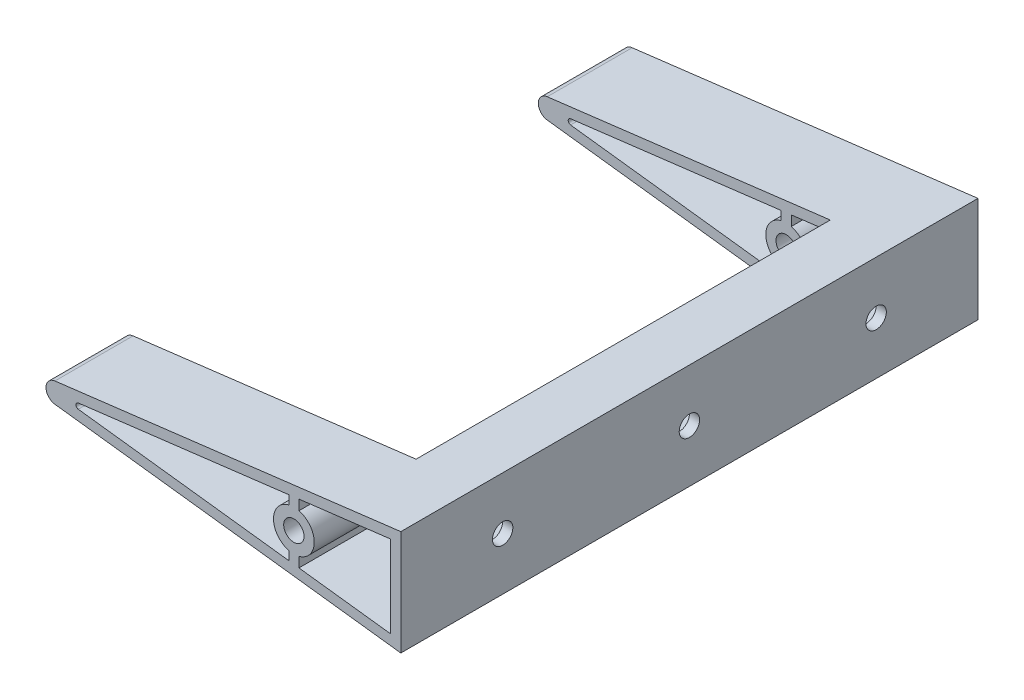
ISO-10303-21;
HEADER;
FILE_DESCRIPTION(('STEP AP214'),'2;1');
FILE_NAME('part.step','',(''),(''),'','','');
FILE_SCHEMA(('AUTOMOTIVE_DESIGN { 1 0 10303 214 1 1 1 1 }'));
ENDSEC;
DATA;
#1=APPLICATION_CONTEXT('core data for automotive mechanical design processes');
#2=APPLICATION_PROTOCOL_DEFINITION('international standard','automotive_design',2000,#1);
#3=PRODUCT_CONTEXT('',#1,'mechanical');
#4=PRODUCT('Part','Part','',(#3));
#5=PRODUCT_RELATED_PRODUCT_CATEGORY('part','',(#4));
#6=PRODUCT_DEFINITION_FORMATION('','',#4);
#7=PRODUCT_DEFINITION_CONTEXT('part definition',#1,'design');
#8=PRODUCT_DEFINITION('design','',#6,#7);
#9=PRODUCT_DEFINITION_SHAPE('','',#8);
#10=(LENGTH_UNIT() NAMED_UNIT(*) SI_UNIT(.MILLI.,.METRE.));
#11=(NAMED_UNIT(*) PLANE_ANGLE_UNIT() SI_UNIT($,.RADIAN.));
#12=(NAMED_UNIT(*) SI_UNIT($,.STERADIAN.) SOLID_ANGLE_UNIT());
#13=UNCERTAINTY_MEASURE_WITH_UNIT(LENGTH_MEASURE(1.E-05),#10,'distance_accuracy_value','');
#14=(GEOMETRIC_REPRESENTATION_CONTEXT(3) GLOBAL_UNCERTAINTY_ASSIGNED_CONTEXT((#13)) GLOBAL_UNIT_ASSIGNED_CONTEXT((#10,
#11,#12)) REPRESENTATION_CONTEXT('',''));
#15=CARTESIAN_POINT('',(0.,0.,0.));
#16=DIRECTION('',(0.,0.,1.));
#17=DIRECTION('',(1.,0.,0.));
#18=AXIS2_PLACEMENT_3D('',#15,#16,#17);
#19=CARTESIAN_POINT('',(-63.3803395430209,0.,120.));
#20=DIRECTION('',(0.,0.,-1.));
#21=DIRECTION('',(-1.,0.,0.));
#22=AXIS2_PLACEMENT_3D('',#19,#20,#21);
#23=CYLINDRICAL_SURFACE('',#22,0.806945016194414);
#24=CARTESIAN_POINT('',(-63.3803395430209,0.,25.));
#25=DIRECTION('',(0.,0.,-1.));
#26=DIRECTION('',(-1.,0.,0.));
#27=AXIS2_PLACEMENT_3D('',#24,#25,#26);
#28=CIRCLE('',#27,0.806945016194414);
#29=CARTESIAN_POINT('',(-63.496985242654,-0.79846981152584,25.));
#30=VERTEX_POINT('',#29);
#31=CARTESIAN_POINT('',(-63.496985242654,0.79846981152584,25.));
#32=VERTEX_POINT('',#31);
#33=EDGE_CURVE('E323',#30,#32,#28,.T.);
#34=ORIENTED_EDGE('',*,*,#33,.F.);
#35=DIRECTION('',(0.,0.,-1.));
#36=VECTOR('',#35,1.);
#37=CARTESIAN_POINT('',(-63.496985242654,-0.79846981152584,120.));
#38=LINE('',#37,#36);
#39=CARTESIAN_POINT('',(-63.496985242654,-0.79846981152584,0.));
#40=VERTEX_POINT('',#39);
#41=EDGE_CURVE('E454',#30,#40,#38,.T.);
#42=ORIENTED_EDGE('',*,*,#41,.T.);
#43=CARTESIAN_POINT('',(-63.3803395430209,0.,0.));
#44=DIRECTION('',(0.,0.,1.));
#45=DIRECTION('',(-1.,0.,0.));
#46=AXIS2_PLACEMENT_3D('',#43,#44,#45);
#47=CIRCLE('',#46,0.806945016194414);
#48=CARTESIAN_POINT('',(-63.496985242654,0.79846981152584,0.));
#49=VERTEX_POINT('',#48);
#50=EDGE_CURVE('E416',#49,#40,#47,.T.);
#51=ORIENTED_EDGE('',*,*,#50,.F.);
#52=DIRECTION('',(0.,0.,-1.));
#53=VECTOR('',#52,1.);
#54=CARTESIAN_POINT('',(-63.496985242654,0.79846981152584,120.));
#55=LINE('',#54,#53);
#56=EDGE_CURVE('E434',#32,#49,#55,.T.);
#57=ORIENTED_EDGE('',*,*,#56,.F.);
#58=EDGE_LOOP('',(#34,#42,#51,#57));
#59=FACE_BOUND('',#58,.T.);
#60=ADVANCED_FACE('F32',(#59),#23,.F.);
#61=CARTESIAN_POINT('',(-63.496985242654,-0.79846981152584,120.));
#62=DIRECTION('',(0.121869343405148,0.992546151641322,0.));
#63=DIRECTION('',(-0.992546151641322,0.121869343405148,0.));
#64=AXIS2_PLACEMENT_3D('',#61,#62,#63);
#65=PLANE('',#64);
#66=DIRECTION('',(-0.992546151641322,0.121869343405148,0.));
#67=VECTOR('',#66,1.);
#68=CARTESIAN_POINT('',(-63.496985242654,-0.79846981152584,25.));
#69=LINE('',#68,#67);
#70=CARTESIAN_POINT('',(-1.50000000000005,-8.41074242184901,25.));
#71=VERTEX_POINT('',#70);
#72=EDGE_CURVE('E321',#71,#30,#69,.T.);
#73=ORIENTED_EDGE('',*,*,#72,.F.);
#74=DIRECTION('',(0.,0.,-1.));
#75=VECTOR('',#74,1.);
#76=CARTESIAN_POINT('',(-1.50000000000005,-8.41074242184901,120.));
#77=LINE('',#76,#75);
#78=CARTESIAN_POINT('',(-1.50000000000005,-8.41074242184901,0.));
#79=VERTEX_POINT('',#78);
#80=EDGE_CURVE('E450',#71,#79,#77,.T.);
#81=ORIENTED_EDGE('',*,*,#80,.T.);
#82=DIRECTION('',(0.992546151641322,-0.121869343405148,0.));
#83=VECTOR('',#82,1.);
#84=CARTESIAN_POINT('',(-63.496985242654,-0.79846981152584,0.));
#85=LINE('',#84,#83);
#86=EDGE_CURVE('E419',#40,#79,#85,.T.);
#87=ORIENTED_EDGE('',*,*,#86,.F.);
#88=ORIENTED_EDGE('',*,*,#41,.F.);
#89=EDGE_LOOP('',(#73,#81,#87,#88));
#90=FACE_BOUND('',#89,.T.);
#91=ADVANCED_FACE('F593',(#90),#65,.T.);
#92=CARTESIAN_POINT('',(-1.50000000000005,-8.41074242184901,120.));
#93=DIRECTION('',(-1.,0.,0.));
#94=DIRECTION('',(0.,-1.,0.));
#95=AXIS2_PLACEMENT_3D('',#92,#93,#94);
#96=PLANE('',#95);
#97=DIRECTION('',(0.,-1.,0.));
#98=VECTOR('',#97,1.);
#99=CARTESIAN_POINT('',(-1.50000000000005,-8.41074242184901,25.));
#100=LINE('',#99,#98);
#101=CARTESIAN_POINT('',(-1.50000000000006,-5.80947501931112,25.));
#102=VERTEX_POINT('',#101);
#103=EDGE_CURVE('E319',#102,#71,#100,.T.);
#104=ORIENTED_EDGE('',*,*,#103,.F.);
#105=DIRECTION('',(0.,0.,-1.));
#106=VECTOR('',#105,1.);
#107=CARTESIAN_POINT('',(-1.50000000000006,-5.80947501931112,120.));
#108=LINE('',#107,#106);
#109=CARTESIAN_POINT('',(-1.50000000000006,-5.80947501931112,0.));
#110=VERTEX_POINT('',#109);
#111=EDGE_CURVE('E446',#102,#110,#108,.T.);
#112=ORIENTED_EDGE('',*,*,#111,.T.);
#113=DIRECTION('',(0.,1.,0.));
#114=VECTOR('',#113,1.);
#115=CARTESIAN_POINT('',(-1.50000000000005,-8.41074242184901,0.));
#116=LINE('',#115,#114);
#117=EDGE_CURVE('E422',#79,#110,#116,.T.);
#118=ORIENTED_EDGE('',*,*,#117,.F.);
#119=ORIENTED_EDGE('',*,*,#80,.F.);
#120=EDGE_LOOP('',(#104,#112,#118,#119));
#121=FACE_BOUND('',#120,.T.);
#122=ADVANCED_FACE('F600',(#121),#96,.T.);
#123=CARTESIAN_POINT('',(0.,0.,120.));
#124=DIRECTION('',(0.,0.,-1.));
#125=DIRECTION('',(-1.,0.,0.));
#126=AXIS2_PLACEMENT_3D('',#123,#124,#125);
#127=CYLINDRICAL_SURFACE('',#126,6.00000000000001);
#128=CARTESIAN_POINT('',(0.,0.,25.));
#129=DIRECTION('',(0.,0.,-1.));
#130=DIRECTION('',(-1.,0.,0.));
#131=AXIS2_PLACEMENT_3D('',#128,#129,#130);
#132=CIRCLE('',#131,6.00000000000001);
#133=CARTESIAN_POINT('',(-1.5,5.80947501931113,25.));
#134=VERTEX_POINT('',#133);
#135=EDGE_CURVE('E317',#134,#102,#132,.F.);
#136=ORIENTED_EDGE('',*,*,#135,.F.);
#137=DIRECTION('',(0.,0.,-1.));
#138=VECTOR('',#137,1.);
#139=CARTESIAN_POINT('',(-1.5,5.80947501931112,120.));
#140=LINE('',#139,#138);
#141=CARTESIAN_POINT('',(-1.5,5.80947501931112,0.));
#142=VERTEX_POINT('',#141);
#143=EDGE_CURVE('E442',#134,#142,#140,.T.);
#144=ORIENTED_EDGE('',*,*,#143,.T.);
#145=CARTESIAN_POINT('',(0.,0.,0.));
#146=DIRECTION('',(0.,0.,-1.));
#147=DIRECTION('',(1.,0.,0.));
#148=AXIS2_PLACEMENT_3D('',#145,#146,#147);
#149=CIRCLE('',#148,6.00000000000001);
#150=EDGE_CURVE('E425',#110,#142,#149,.T.);
#151=ORIENTED_EDGE('',*,*,#150,.F.);
#152=ORIENTED_EDGE('',*,*,#111,.F.);
#153=EDGE_LOOP('',(#136,#144,#151,#152));
#154=FACE_BOUND('',#153,.T.);
#155=ADVANCED_FACE('F801',(#154),#127,.T.);
#156=CARTESIAN_POINT('',(-1.5,8.41074242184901,120.));
#157=DIRECTION('',(-1.,0.,0.));
#158=DIRECTION('',(0.,-1.,0.));
#159=AXIS2_PLACEMENT_3D('',#156,#157,#158);
#160=PLANE('',#159);
#161=DIRECTION('',(0.,-1.,0.));
#162=VECTOR('',#161,1.);
#163=CARTESIAN_POINT('',(-1.5,8.41074242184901,25.));
#164=LINE('',#163,#162);
#165=CARTESIAN_POINT('',(-1.49999999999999,8.41074242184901,25.));
#166=VERTEX_POINT('',#165);
#167=EDGE_CURVE('E315',#166,#134,#164,.T.);
#168=ORIENTED_EDGE('',*,*,#167,.F.);
#169=DIRECTION('',(0.,0.,-1.));
#170=VECTOR('',#169,1.);
#171=CARTESIAN_POINT('',(-1.5,8.41074242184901,120.));
#172=LINE('',#171,#170);
#173=CARTESIAN_POINT('',(-1.5,8.41074242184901,0.));
#174=VERTEX_POINT('',#173);
#175=EDGE_CURVE('E438',#166,#174,#172,.T.);
#176=ORIENTED_EDGE('',*,*,#175,.T.);
#177=DIRECTION('',(0.,1.,0.));
#178=VECTOR('',#177,1.);
#179=CARTESIAN_POINT('',(-1.5,8.41074242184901,0.));
#180=LINE('',#179,#178);
#181=EDGE_CURVE('E428',#142,#174,#180,.T.);
#182=ORIENTED_EDGE('',*,*,#181,.F.);
#183=ORIENTED_EDGE('',*,*,#143,.F.);
#184=EDGE_LOOP('',(#168,#176,#182,#183));
#185=FACE_BOUND('',#184,.T.);
#186=ADVANCED_FACE('F811',(#185),#160,.T.);
#187=CARTESIAN_POINT('',(-63.496985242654,0.79846981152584,120.));
#188=DIRECTION('',(0.121869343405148,-0.992546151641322,0.));
#189=DIRECTION('',(0.992546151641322,0.121869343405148,0.));
#190=AXIS2_PLACEMENT_3D('',#187,#188,#189);
#191=PLANE('',#190);
#192=DIRECTION('',(0.992546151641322,0.121869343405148,0.));
#193=VECTOR('',#192,1.);
#194=CARTESIAN_POINT('',(-63.496985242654,0.79846981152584,25.));
#195=LINE('',#194,#193);
#196=EDGE_CURVE('E313',#32,#166,#195,.T.);
#197=ORIENTED_EDGE('',*,*,#196,.F.);
#198=ORIENTED_EDGE('',*,*,#56,.T.);
#199=DIRECTION('',(-0.992546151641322,-0.121869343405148,0.));
#200=VECTOR('',#199,1.);
#201=CARTESIAN_POINT('',(-63.496985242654,0.79846981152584,0.));
#202=LINE('',#201,#200);
#203=EDGE_CURVE('E431',#174,#49,#202,.T.);
#204=ORIENTED_EDGE('',*,*,#203,.F.);
#205=ORIENTED_EDGE('',*,*,#175,.F.);
#206=EDGE_LOOP('',(#197,#198,#204,#205));
#207=FACE_BOUND('',#206,.T.);
#208=ADVANCED_FACE('F821',(#207),#191,.T.);
#209=CARTESIAN_POINT('',(0.,0.,120.));
#210=DIRECTION('',(0.,0.,-1.));
#211=DIRECTION('',(-1.,0.,0.));
#212=AXIS2_PLACEMENT_3D('',#209,#210,#211);
#213=CYLINDRICAL_SURFACE('',#212,3.);
#214=CARTESIAN_POINT('',(0.,0.,25.));
#215=DIRECTION('',(0.,0.,-1.));
#216=DIRECTION('',(-1.,0.,0.));
#217=AXIS2_PLACEMENT_3D('',#214,#215,#216);
#218=CIRCLE('',#217,3.);
#219=CARTESIAN_POINT('',(-3.,0.,25.));
#220=VERTEX_POINT('',#219);
#221=EDGE_CURVE('E310',#220,#220,#218,.T.);
#222=ORIENTED_EDGE('',*,*,#221,.F.);
#223=EDGE_LOOP('',(#222));
#224=FACE_BOUND('',#223,.T.);
#225=CARTESIAN_POINT('',(0.,0.,0.));
#226=DIRECTION('',(0.,0.,1.));
#227=DIRECTION('',(-1.,0.,0.));
#228=AXIS2_PLACEMENT_3D('',#225,#226,#227);
#229=CIRCLE('',#228,3.);
#230=CARTESIAN_POINT('',(-3.,0.,0.));
#231=VERTEX_POINT('',#230);
#232=EDGE_CURVE('E413',#231,#231,#229,.T.);
#233=ORIENTED_EDGE('',*,*,#232,.F.);
#234=EDGE_LOOP('',(#233));
#235=FACE_BOUND('',#234,.T.);
#236=ADVANCED_FACE('F832',(#224,#235),#213,.F.);
#237=CARTESIAN_POINT('',(1.5,8.77909610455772,120.));
#238=DIRECTION('',(1.,0.,0.));
#239=DIRECTION('',(0.,1.,0.));
#240=AXIS2_PLACEMENT_3D('',#237,#238,#239);
#241=PLANE('',#240);
#242=DIRECTION('',(0.,1.,0.));
#243=VECTOR('',#242,1.);
#244=CARTESIAN_POINT('',(1.5,8.77909610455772,25.));
#245=LINE('',#244,#243);
#246=CARTESIAN_POINT('',(1.5,5.80947501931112,25.));
#247=VERTEX_POINT('',#246);
#248=CARTESIAN_POINT('',(1.5,8.77909610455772,25.));
#249=VERTEX_POINT('',#248);
#250=EDGE_CURVE('E262',#247,#249,#245,.T.);
#251=ORIENTED_EDGE('',*,*,#250,.F.);
#252=DIRECTION('',(0.,0.,-1.));
#253=VECTOR('',#252,1.);
#254=CARTESIAN_POINT('',(1.49999999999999,5.80947501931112,120.));
#255=LINE('',#254,#253);
#256=CARTESIAN_POINT('',(1.49999999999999,5.80947501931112,0.));
#257=VERTEX_POINT('',#256);
#258=EDGE_CURVE('E409',#247,#257,#255,.T.);
#259=ORIENTED_EDGE('',*,*,#258,.T.);
#260=DIRECTION('',(0.,-1.,0.));
#261=VECTOR('',#260,1.);
#262=CARTESIAN_POINT('',(1.5,8.77909610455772,0.));
#263=LINE('',#262,#261);
#264=CARTESIAN_POINT('',(1.5,8.77909610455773,0.));
#265=VERTEX_POINT('',#264);
#266=EDGE_CURVE('E375',#265,#257,#263,.T.);
#267=ORIENTED_EDGE('',*,*,#266,.F.);
#268=DIRECTION('',(0.,0.,-1.));
#269=VECTOR('',#268,1.);
#270=CARTESIAN_POINT('',(1.5,8.77909610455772,120.));
#271=LINE('',#270,#269);
#272=EDGE_CURVE('E393',#249,#265,#271,.T.);
#273=ORIENTED_EDGE('',*,*,#272,.F.);
#274=EDGE_LOOP('',(#251,#259,#267,#273));
#275=FACE_BOUND('',#274,.T.);
#276=ADVANCED_FACE('F589',(#275),#241,.T.);
#277=CARTESIAN_POINT('',(0.,0.,120.));
#278=DIRECTION('',(0.,0.,-1.));
#279=DIRECTION('',(-1.,0.,0.));
#280=AXIS2_PLACEMENT_3D('',#277,#278,#279);
#281=CYLINDRICAL_SURFACE('',#280,5.99999999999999);
#282=CARTESIAN_POINT('',(0.,0.,25.));
#283=DIRECTION('',(0.,0.,-1.));
#284=DIRECTION('',(-1.,0.,0.));
#285=AXIS2_PLACEMENT_3D('',#282,#283,#284);
#286=CIRCLE('',#285,5.99999999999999);
#287=CARTESIAN_POINT('',(1.49999999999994,-5.80947501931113,25.));
#288=VERTEX_POINT('',#287);
#289=EDGE_CURVE('E304',#288,#247,#286,.F.);
#290=ORIENTED_EDGE('',*,*,#289,.F.);
#291=DIRECTION('',(0.,0.,-1.));
#292=VECTOR('',#291,1.);
#293=CARTESIAN_POINT('',(1.49999999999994,-5.80947501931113,120.));
#294=LINE('',#293,#292);
#295=CARTESIAN_POINT('',(1.49999999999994,-5.80947501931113,0.));
#296=VERTEX_POINT('',#295);
#297=EDGE_CURVE('E405',#288,#296,#294,.T.);
#298=ORIENTED_EDGE('',*,*,#297,.T.);
#299=CARTESIAN_POINT('',(0.,0.,0.));
#300=DIRECTION('',(0.,0.,-1.));
#301=DIRECTION('',(1.,0.,0.));
#302=AXIS2_PLACEMENT_3D('',#299,#300,#301);
#303=CIRCLE('',#302,5.99999999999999);
#304=EDGE_CURVE('E378',#257,#296,#303,.T.);
#305=ORIENTED_EDGE('',*,*,#304,.F.);
#306=ORIENTED_EDGE('',*,*,#258,.F.);
#307=EDGE_LOOP('',(#290,#298,#305,#306));
#308=FACE_BOUND('',#307,.T.);
#309=ADVANCED_FACE('F580',(#308),#281,.T.);
#310=CARTESIAN_POINT('',(1.49999999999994,-8.77909610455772,120.));
#311=DIRECTION('',(1.,0.,0.));
#312=DIRECTION('',(0.,1.,0.));
#313=AXIS2_PLACEMENT_3D('',#310,#311,#312);
#314=PLANE('',#313);
#315=DIRECTION('',(0.,1.,0.));
#316=VECTOR('',#315,1.);
#317=CARTESIAN_POINT('',(1.49999999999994,-8.77909610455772,25.));
#318=LINE('',#317,#316);
#319=CARTESIAN_POINT('',(1.49999999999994,-8.77909610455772,25.));
#320=VERTEX_POINT('',#319);
#321=EDGE_CURVE('E306',#320,#288,#318,.T.);
#322=ORIENTED_EDGE('',*,*,#321,.F.);
#323=DIRECTION('',(0.,0.,-1.));
#324=VECTOR('',#323,1.);
#325=CARTESIAN_POINT('',(1.49999999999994,-8.77909610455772,120.));
#326=LINE('',#325,#324);
#327=CARTESIAN_POINT('',(1.49999999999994,-8.77909610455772,0.));
#328=VERTEX_POINT('',#327);
#329=EDGE_CURVE('E401',#320,#328,#326,.T.);
#330=ORIENTED_EDGE('',*,*,#329,.T.);
#331=DIRECTION('',(0.,-1.,0.));
#332=VECTOR('',#331,1.);
#333=CARTESIAN_POINT('',(1.49999999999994,-8.77909610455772,0.));
#334=LINE('',#333,#332);
#335=EDGE_CURVE('E381',#296,#328,#334,.T.);
#336=ORIENTED_EDGE('',*,*,#335,.F.);
#337=ORIENTED_EDGE('',*,*,#297,.F.);
#338=EDGE_LOOP('',(#322,#330,#336,#337));
#339=FACE_BOUND('',#338,.T.);
#340=ADVANCED_FACE('F586',(#339),#314,.T.);
#341=CARTESIAN_POINT('',(0.,0.,0.));
#342=DIRECTION('',(0.,0.,-1.));
#343=DIRECTION('',(-1.,0.,0.));
#344=AXIS2_PLACEMENT_3D('',#341,#342,#343);
#345=PLANE('',#344);
#346=ORIENTED_EDGE('',*,*,#232,.T.);
#347=EDGE_LOOP('',(#346));
#348=FACE_BOUND('',#347,.T.);
#349=DIRECTION('',(0.992546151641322,-0.121869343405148,0.));
#350=VECTOR('',#349,1.);
#351=CARTESIAN_POINT('',(-94.6165271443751,0.,0.));
#352=LINE('',#351,#350);
#353=CARTESIAN_POINT('',(-70.3656080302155,-2.97763845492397,0.));
#354=VERTEX_POINT('',#353);
#355=CARTESIAN_POINT('',(31.4999999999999,-15.4851624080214,0.));
#356=VERTEX_POINT('',#355);
#357=EDGE_CURVE('E458',#354,#356,#352,.T.);
#358=ORIENTED_EDGE('',*,*,#357,.F.);
#359=CARTESIAN_POINT('',(-70.,0.,0.));
#360=DIRECTION('',(0.,0.,-1.));
#361=DIRECTION('',(-1.,0.,0.));
#362=AXIS2_PLACEMENT_3D('',#359,#360,#361);
#363=CIRCLE('',#362,3.);
#364=CARTESIAN_POINT('',(-70.3656080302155,2.97763845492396,0.));
#365=VERTEX_POINT('',#364);
#366=EDGE_CURVE('E482',#354,#365,#363,.T.);
#367=ORIENTED_EDGE('',*,*,#366,.T.);
#368=DIRECTION('',(-0.992546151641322,-0.121869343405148,0.));
#369=VECTOR('',#368,1.);
#370=CARTESIAN_POINT('',(-94.6165271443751,0.,0.));
#371=LINE('',#370,#369);
#372=CARTESIAN_POINT('',(31.5,15.4851624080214,0.));
#373=VERTEX_POINT('',#372);
#374=EDGE_CURVE('E462',#373,#365,#371,.T.);
#375=ORIENTED_EDGE('',*,*,#374,.F.);
#376=DIRECTION('',(0.,1.,0.));
#377=VECTOR('',#376,1.);
#378=CARTESIAN_POINT('',(31.5,15.4851624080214,0.));
#379=LINE('',#378,#377);
#380=EDGE_CURVE('E460',#356,#373,#379,.T.);
#381=ORIENTED_EDGE('',*,*,#380,.F.);
#382=EDGE_LOOP('',(#358,#367,#375,#381));
#383=FACE_BOUND('',#382,.T.);
#384=ORIENTED_EDGE('',*,*,#203,.T.);
#385=ORIENTED_EDGE('',*,*,#50,.T.);
#386=ORIENTED_EDGE('',*,*,#86,.T.);
#387=ORIENTED_EDGE('',*,*,#117,.T.);
#388=ORIENTED_EDGE('',*,*,#150,.T.);
#389=ORIENTED_EDGE('',*,*,#181,.T.);
#390=EDGE_LOOP('',(#384,#385,#386,#387,#388,#389));
#391=FACE_BOUND('',#390,.T.);
#392=DIRECTION('',(-0.992546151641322,-0.121869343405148,0.));
#393=VECTOR('',#392,1.);
#394=CARTESIAN_POINT('',(1.5,8.77909610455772,0.));
#395=LINE('',#394,#393);
#396=CARTESIAN_POINT('',(28.5,12.0942792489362,0.));
#397=VERTEX_POINT('',#396);
#398=EDGE_CURVE('E390',#397,#265,#395,.T.);
#399=ORIENTED_EDGE('',*,*,#398,.T.);
#400=ORIENTED_EDGE('',*,*,#266,.T.);
#401=ORIENTED_EDGE('',*,*,#304,.T.);
#402=ORIENTED_EDGE('',*,*,#335,.T.);
#403=DIRECTION('',(0.992546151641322,-0.121869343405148,0.));
#404=VECTOR('',#403,1.);
#405=CARTESIAN_POINT('',(1.49999999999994,-8.77909610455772,0.));
#406=LINE('',#405,#404);
#407=CARTESIAN_POINT('',(28.4999999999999,-12.0942792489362,0.));
#408=VERTEX_POINT('',#407);
#409=EDGE_CURVE('E384',#328,#408,#406,.T.);
#410=ORIENTED_EDGE('',*,*,#409,.T.);
#411=DIRECTION('',(0.,1.,0.));
#412=VECTOR('',#411,1.);
#413=CARTESIAN_POINT('',(28.5,12.0942792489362,0.));
#414=LINE('',#413,#412);
#415=EDGE_CURVE('E387',#408,#397,#414,.T.);
#416=ORIENTED_EDGE('',*,*,#415,.T.);
#417=EDGE_LOOP('',(#399,#400,#401,#402,#410,#416));
#418=FACE_BOUND('',#417,.T.);
#419=ADVANCED_FACE('F525',(#348,#383,#391,#418),#345,.T.);
#420=CARTESIAN_POINT('',(-94.6165271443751,0.,120.));
#421=DIRECTION('',(0.121869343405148,0.992546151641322,0.));
#422=DIRECTION('',(-0.992546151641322,0.121869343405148,0.));
#423=AXIS2_PLACEMENT_3D('',#420,#421,#422);
#424=PLANE('',#423);
#425=DIRECTION('',(-0.992546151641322,0.121869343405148,0.));
#426=VECTOR('',#425,1.);
#427=CARTESIAN_POINT('',(-94.6165271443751,0.,25.));
#428=LINE('',#427,#426);
#429=CARTESIAN_POINT('',(13.,-13.2136480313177,25.));
#430=VERTEX_POINT('',#429);
#431=CARTESIAN_POINT('',(-70.3656080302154,-2.97763845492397,25.));
#432=VERTEX_POINT('',#431);
#433=EDGE_CURVE('E327',#430,#432,#428,.T.);
#434=ORIENTED_EDGE('',*,*,#433,.T.);
#435=DIRECTION('',(0.,0.,-1.));
#436=VECTOR('',#435,1.);
#437=CARTESIAN_POINT('',(-70.3656080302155,-2.97763845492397,120.));
#438=LINE('',#437,#436);
#439=EDGE_CURVE('E479',#432,#354,#438,.T.);
#440=ORIENTED_EDGE('',*,*,#439,.T.);
#441=ORIENTED_EDGE('',*,*,#357,.T.);
#442=DIRECTION('',(0.,0.,-1.));
#443=VECTOR('',#442,1.);
#444=CARTESIAN_POINT('',(31.4999999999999,-15.4851624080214,120.));
#445=LINE('',#444,#443);
#446=CARTESIAN_POINT('',(31.4999999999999,-15.4851624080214,170.));
#447=VERTEX_POINT('',#446);
#448=EDGE_CURVE('E468',#447,#356,#445,.T.);
#449=ORIENTED_EDGE('',*,*,#448,.F.);
#450=DIRECTION('',(0.992546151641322,-0.121869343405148,0.));
#451=VECTOR('',#450,1.);
#452=CARTESIAN_POINT('',(-94.6165271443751,0.,170.));
#453=LINE('',#452,#451);
#454=CARTESIAN_POINT('',(-70.3656080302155,-2.97763845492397,170.));
#455=VERTEX_POINT('',#454);
#456=EDGE_CURVE('E368',#455,#447,#453,.T.);
#457=ORIENTED_EDGE('',*,*,#456,.F.);
#458=DIRECTION('',(0.,0.,-1.));
#459=VECTOR('',#458,1.);
#460=CARTESIAN_POINT('',(-70.3656080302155,-2.97763845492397,120.));
#461=LINE('',#460,#459);
#462=CARTESIAN_POINT('',(-70.3656080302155,-2.97763845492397,147.));
#463=VERTEX_POINT('',#462);
#464=EDGE_CURVE('E249',#455,#463,#461,.T.);
#465=ORIENTED_EDGE('',*,*,#464,.T.);
#466=DIRECTION('',(0.992546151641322,-0.121869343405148,0.));
#467=VECTOR('',#466,1.);
#468=CARTESIAN_POINT('',(-94.6165271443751,0.,147.));
#469=LINE('',#468,#467);
#470=CARTESIAN_POINT('',(13.,-13.2136480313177,147.));
#471=VERTEX_POINT('',#470);
#472=EDGE_CURVE('E242',#463,#471,#469,.T.);
#473=ORIENTED_EDGE('',*,*,#472,.T.);
#474=DIRECTION('',(0.,0.,-1.));
#475=VECTOR('',#474,1.);
#476=CARTESIAN_POINT('',(13.,-13.2136480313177,120.));
#477=LINE('',#476,#475);
#478=EDGE_CURVE('E246',#471,#430,#477,.T.);
#479=ORIENTED_EDGE('',*,*,#478,.T.);
#480=EDGE_LOOP('',(#434,#440,#441,#449,#457,#465,#473,#479));
#481=FACE_BOUND('',#480,.T.);
#482=ADVANCED_FACE('F245',(#481),#424,.F.);
#483=CARTESIAN_POINT('',(31.5,15.4851624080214,120.));
#484=DIRECTION('',(-1.,0.,0.));
#485=DIRECTION('',(0.,-1.,0.));
#486=AXIS2_PLACEMENT_3D('',#483,#484,#485);
#487=PLANE('',#486);
#488=CARTESIAN_POINT('',(31.4999999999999,-1.1292108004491E-13,30.));
#489=DIRECTION('',(1.,0.,0.));
#490=DIRECTION('',(0.,1.,0.));
#491=AXIS2_PLACEMENT_3D('',#488,#489,#490);
#492=CIRCLE('',#491,3.);
#493=CARTESIAN_POINT('',(31.5,2.99999999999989,30.));
#494=VERTEX_POINT('',#493);
#495=EDGE_CURVE('E503',#494,#494,#492,.T.);
#496=ORIENTED_EDGE('',*,*,#495,.F.);
#497=EDGE_LOOP('',(#496));
#498=FACE_BOUND('',#497,.T.);
#499=CARTESIAN_POINT('',(31.4999999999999,-1.1292108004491E-13,85.));
#500=DIRECTION('',(1.,0.,0.));
#501=DIRECTION('',(0.,1.,0.));
#502=AXIS2_PLACEMENT_3D('',#499,#500,#501);
#503=CIRCLE('',#502,3.00000000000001);
#504=CARTESIAN_POINT('',(31.5,2.9999999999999,85.));
#505=VERTEX_POINT('',#504);
#506=EDGE_CURVE('E494',#505,#505,#503,.T.);
#507=ORIENTED_EDGE('',*,*,#506,.F.);
#508=EDGE_LOOP('',(#507));
#509=FACE_BOUND('',#508,.T.);
#510=CARTESIAN_POINT('',(31.4999999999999,-1.1292108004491E-13,140.));
#511=DIRECTION('',(1.,0.,0.));
#512=DIRECTION('',(0.,1.,0.));
#513=AXIS2_PLACEMENT_3D('',#510,#511,#512);
#514=CIRCLE('',#513,2.99999999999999);
#515=CARTESIAN_POINT('',(31.5,2.99999999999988,140.));
#516=VERTEX_POINT('',#515);
#517=EDGE_CURVE('E491',#516,#516,#514,.T.);
#518=ORIENTED_EDGE('',*,*,#517,.F.);
#519=EDGE_LOOP('',(#518));
#520=FACE_BOUND('',#519,.T.);
#521=ORIENTED_EDGE('',*,*,#380,.T.);
#522=DIRECTION('',(0.,0.,-1.));
#523=VECTOR('',#522,1.);
#524=CARTESIAN_POINT('',(31.5,15.4851624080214,120.));
#525=LINE('',#524,#523);
#526=CARTESIAN_POINT('',(31.5,15.4851624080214,170.));
#527=VERTEX_POINT('',#526);
#528=EDGE_CURVE('E465',#527,#373,#525,.T.);
#529=ORIENTED_EDGE('',*,*,#528,.F.);
#530=DIRECTION('',(0.,1.,0.));
#531=VECTOR('',#530,1.);
#532=CARTESIAN_POINT('',(31.5,15.4851624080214,170.));
#533=LINE('',#532,#531);
#534=EDGE_CURVE('E370',#447,#527,#533,.T.);
#535=ORIENTED_EDGE('',*,*,#534,.F.);
#536=ORIENTED_EDGE('',*,*,#448,.T.);
#537=EDGE_LOOP('',(#521,#529,#535,#536));
#538=FACE_BOUND('',#537,.T.);
#539=ADVANCED_FACE('F510',(#498,#509,#520,#538),#487,.F.);
#540=CARTESIAN_POINT('',(-94.6165271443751,0.,120.));
#541=DIRECTION('',(0.121869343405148,-0.992546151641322,0.));
#542=DIRECTION('',(0.992546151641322,0.121869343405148,0.));
#543=AXIS2_PLACEMENT_3D('',#540,#541,#542);
#544=PLANE('',#543);
#545=ORIENTED_EDGE('',*,*,#374,.T.);
#546=DIRECTION('',(0.,0.,-1.));
#547=VECTOR('',#546,1.);
#548=CARTESIAN_POINT('',(-70.3656080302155,2.97763845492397,120.));
#549=LINE('',#548,#547);
#550=CARTESIAN_POINT('',(-70.3656080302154,2.97763845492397,25.));
#551=VERTEX_POINT('',#550);
#552=EDGE_CURVE('E485',#365,#551,#549,.F.);
#553=ORIENTED_EDGE('',*,*,#552,.T.);
#554=DIRECTION('',(0.992546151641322,0.121869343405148,0.));
#555=VECTOR('',#554,1.);
#556=CARTESIAN_POINT('',(-94.6165271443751,0.,25.));
#557=LINE('',#556,#555);
#558=CARTESIAN_POINT('',(13.,13.2136480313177,25.));
#559=VERTEX_POINT('',#558);
#560=EDGE_CURVE('E325',#551,#559,#557,.T.);
#561=ORIENTED_EDGE('',*,*,#560,.T.);
#562=DIRECTION('',(0.,0.,1.));
#563=VECTOR('',#562,1.);
#564=CARTESIAN_POINT('',(13.,13.2136480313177,120.));
#565=LINE('',#564,#563);
#566=CARTESIAN_POINT('',(13.,13.2136480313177,147.));
#567=VERTEX_POINT('',#566);
#568=EDGE_CURVE('E263',#559,#567,#565,.T.);
#569=ORIENTED_EDGE('',*,*,#568,.T.);
#570=DIRECTION('',(-0.992546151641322,-0.121869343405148,0.));
#571=VECTOR('',#570,1.);
#572=CARTESIAN_POINT('',(-94.6165271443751,0.,147.));
#573=LINE('',#572,#571);
#574=CARTESIAN_POINT('',(-70.3656080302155,2.97763845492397,147.));
#575=VERTEX_POINT('',#574);
#576=EDGE_CURVE('E252',#567,#575,#573,.T.);
#577=ORIENTED_EDGE('',*,*,#576,.T.);
#578=DIRECTION('',(0.,0.,-1.));
#579=VECTOR('',#578,1.);
#580=CARTESIAN_POINT('',(-70.3656080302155,2.97763845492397,120.));
#581=LINE('',#580,#579);
#582=CARTESIAN_POINT('',(-70.3656080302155,2.97763845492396,170.));
#583=VERTEX_POINT('',#582);
#584=EDGE_CURVE('E49',#575,#583,#581,.F.);
#585=ORIENTED_EDGE('',*,*,#584,.T.);
#586=DIRECTION('',(-0.992546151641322,-0.121869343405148,0.));
#587=VECTOR('',#586,1.);
#588=CARTESIAN_POINT('',(-94.6165271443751,0.,170.));
#589=LINE('',#588,#587);
#590=EDGE_CURVE('E373',#527,#583,#589,.T.);
#591=ORIENTED_EDGE('',*,*,#590,.F.);
#592=ORIENTED_EDGE('',*,*,#528,.T.);
#593=EDGE_LOOP('',(#545,#553,#561,#569,#577,#585,#591,#592));
#594=FACE_BOUND('',#593,.T.);
#595=ADVANCED_FACE('F513',(#594),#544,.F.);
#596=CARTESIAN_POINT('',(-63.3803395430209,0.,147.));
#597=DIRECTION('',(0.,0.,1.));
#598=DIRECTION('',(1.,0.,0.));
#599=AXIS2_PLACEMENT_3D('',#596,#597,#598);
#600=CIRCLE('',#599,0.806945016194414);
#601=CARTESIAN_POINT('',(-63.496985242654,0.79846981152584,147.));
#602=VERTEX_POINT('',#601);
#603=CARTESIAN_POINT('',(-63.496985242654,-0.79846981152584,147.));
#604=VERTEX_POINT('',#603);
#605=EDGE_CURVE('E297',#602,#604,#600,.T.);
#606=ORIENTED_EDGE('',*,*,#605,.F.);
#607=CARTESIAN_POINT('',(-63.496985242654,0.79846981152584,170.));
#608=VERTEX_POINT('',#607);
#609=EDGE_CURVE('E435',#608,#602,#55,.T.);
#610=ORIENTED_EDGE('',*,*,#609,.F.);
#611=CARTESIAN_POINT('',(-63.3803395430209,0.,170.));
#612=DIRECTION('',(0.,0.,1.));
#613=DIRECTION('',(-1.,0.,0.));
#614=AXIS2_PLACEMENT_3D('',#611,#612,#613);
#615=CIRCLE('',#614,0.806945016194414);
#616=CARTESIAN_POINT('',(-63.496985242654,-0.79846981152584,170.));
#617=VERTEX_POINT('',#616);
#618=EDGE_CURVE('E350',#608,#617,#615,.T.);
#619=ORIENTED_EDGE('',*,*,#618,.T.);
#620=EDGE_CURVE('E455',#617,#604,#38,.T.);
#621=ORIENTED_EDGE('',*,*,#620,.T.);
#622=EDGE_LOOP('',(#606,#610,#619,#621));
#623=FACE_BOUND('',#622,.T.);
#624=ADVANCED_FACE('F596',(#623),#23,.F.);
#625=DIRECTION('',(0.992546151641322,-0.121869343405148,0.));
#626=VECTOR('',#625,1.);
#627=CARTESIAN_POINT('',(-63.496985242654,-0.79846981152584,147.));
#628=LINE('',#627,#626);
#629=CARTESIAN_POINT('',(-1.50000000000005,-8.41074242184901,147.));
#630=VERTEX_POINT('',#629);
#631=EDGE_CURVE('E295',#604,#630,#628,.T.);
#632=ORIENTED_EDGE('',*,*,#631,.F.);
#633=ORIENTED_EDGE('',*,*,#620,.F.);
#634=DIRECTION('',(0.992546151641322,-0.121869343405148,0.));
#635=VECTOR('',#634,1.);
#636=CARTESIAN_POINT('',(-63.496985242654,-0.79846981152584,170.));
#637=LINE('',#636,#635);
#638=CARTESIAN_POINT('',(-1.50000000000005,-8.41074242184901,170.));
#639=VERTEX_POINT('',#638);
#640=EDGE_CURVE('E353',#617,#639,#637,.T.);
#641=ORIENTED_EDGE('',*,*,#640,.T.);
#642=EDGE_CURVE('E451',#639,#630,#77,.T.);
#643=ORIENTED_EDGE('',*,*,#642,.T.);
#644=EDGE_LOOP('',(#632,#633,#641,#643));
#645=FACE_BOUND('',#644,.T.);
#646=ADVANCED_FACE('F603',(#645),#65,.T.);
#647=DIRECTION('',(0.,1.,0.));
#648=VECTOR('',#647,1.);
#649=CARTESIAN_POINT('',(-1.50000000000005,-8.41074242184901,147.));
#650=LINE('',#649,#648);
#651=CARTESIAN_POINT('',(-1.50000000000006,-5.80947501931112,147.));
#652=VERTEX_POINT('',#651);
#653=EDGE_CURVE('E293',#630,#652,#650,.T.);
#654=ORIENTED_EDGE('',*,*,#653,.F.);
#655=ORIENTED_EDGE('',*,*,#642,.F.);
#656=DIRECTION('',(0.,1.,0.));
#657=VECTOR('',#656,1.);
#658=CARTESIAN_POINT('',(-1.50000000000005,-8.41074242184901,170.));
#659=LINE('',#658,#657);
#660=CARTESIAN_POINT('',(-1.50000000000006,-5.80947501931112,170.));
#661=VERTEX_POINT('',#660);
#662=EDGE_CURVE('E356',#639,#661,#659,.T.);
#663=ORIENTED_EDGE('',*,*,#662,.T.);
#664=EDGE_CURVE('E447',#661,#652,#108,.T.);
#665=ORIENTED_EDGE('',*,*,#664,.T.);
#666=EDGE_LOOP('',(#654,#655,#663,#665));
#667=FACE_BOUND('',#666,.T.);
#668=ADVANCED_FACE('F612',(#667),#96,.T.);
#669=CARTESIAN_POINT('',(0.,0.,147.));
#670=DIRECTION('',(0.,0.,1.));
#671=DIRECTION('',(1.,0.,0.));
#672=AXIS2_PLACEMENT_3D('',#669,#670,#671);
#673=CIRCLE('',#672,6.00000000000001);
#674=CARTESIAN_POINT('',(-1.5,5.80947501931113,147.));
#675=VERTEX_POINT('',#674);
#676=EDGE_CURVE('E291',#652,#675,#673,.F.);
#677=ORIENTED_EDGE('',*,*,#676,.F.);
#678=ORIENTED_EDGE('',*,*,#664,.F.);
#679=CARTESIAN_POINT('',(0.,0.,170.));
#680=DIRECTION('',(0.,0.,-1.));
#681=DIRECTION('',(1.,0.,0.));
#682=AXIS2_PLACEMENT_3D('',#679,#680,#681);
#683=CIRCLE('',#682,6.00000000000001);
#684=CARTESIAN_POINT('',(-1.5,5.80947501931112,170.));
#685=VERTEX_POINT('',#684);
#686=EDGE_CURVE('E359',#661,#685,#683,.T.);
#687=ORIENTED_EDGE('',*,*,#686,.T.);
#688=EDGE_CURVE('E443',#685,#675,#140,.T.);
#689=ORIENTED_EDGE('',*,*,#688,.T.);
#690=EDGE_LOOP('',(#677,#678,#687,#689));
#691=FACE_BOUND('',#690,.T.);
#692=ADVANCED_FACE('F629',(#691),#127,.T.);
#693=DIRECTION('',(0.,1.,0.));
#694=VECTOR('',#693,1.);
#695=CARTESIAN_POINT('',(-1.5,8.41074242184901,147.));
#696=LINE('',#695,#694);
#697=CARTESIAN_POINT('',(-1.5,8.41074242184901,147.));
#698=VERTEX_POINT('',#697);
#699=EDGE_CURVE('E289',#675,#698,#696,.T.);
#700=ORIENTED_EDGE('',*,*,#699,.F.);
#701=ORIENTED_EDGE('',*,*,#688,.F.);
#702=DIRECTION('',(0.,1.,0.));
#703=VECTOR('',#702,1.);
#704=CARTESIAN_POINT('',(-1.5,8.41074242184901,170.));
#705=LINE('',#704,#703);
#706=CARTESIAN_POINT('',(-1.5,8.41074242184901,170.));
#707=VERTEX_POINT('',#706);
#708=EDGE_CURVE('E362',#685,#707,#705,.T.);
#709=ORIENTED_EDGE('',*,*,#708,.T.);
#710=EDGE_CURVE('E439',#707,#698,#172,.T.);
#711=ORIENTED_EDGE('',*,*,#710,.T.);
#712=EDGE_LOOP('',(#700,#701,#709,#711));
#713=FACE_BOUND('',#712,.T.);
#714=ADVANCED_FACE('F626',(#713),#160,.T.);
#715=DIRECTION('',(-0.992546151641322,-0.121869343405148,0.));
#716=VECTOR('',#715,1.);
#717=CARTESIAN_POINT('',(-63.496985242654,0.79846981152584,147.));
#718=LINE('',#717,#716);
#719=EDGE_CURVE('E287',#698,#602,#718,.T.);
#720=ORIENTED_EDGE('',*,*,#719,.F.);
#721=ORIENTED_EDGE('',*,*,#710,.F.);
#722=DIRECTION('',(-0.992546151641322,-0.121869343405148,0.));
#723=VECTOR('',#722,1.);
#724=CARTESIAN_POINT('',(-63.496985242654,0.79846981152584,170.));
#725=LINE('',#724,#723);
#726=EDGE_CURVE('E365',#707,#608,#725,.T.);
#727=ORIENTED_EDGE('',*,*,#726,.T.);
#728=ORIENTED_EDGE('',*,*,#609,.T.);
#729=EDGE_LOOP('',(#720,#721,#727,#728));
#730=FACE_BOUND('',#729,.T.);
#731=ADVANCED_FACE('F620',(#730),#191,.T.);
#732=CARTESIAN_POINT('',(0.,0.,147.));
#733=DIRECTION('',(0.,0.,1.));
#734=DIRECTION('',(1.,0.,0.));
#735=AXIS2_PLACEMENT_3D('',#732,#733,#734);
#736=CIRCLE('',#735,3.);
#737=CARTESIAN_POINT('',(3.,0.,147.));
#738=VERTEX_POINT('',#737);
#739=EDGE_CURVE('E284',#738,#738,#736,.T.);
#740=ORIENTED_EDGE('',*,*,#739,.F.);
#741=EDGE_LOOP('',(#740));
#742=FACE_BOUND('',#741,.T.);
#743=CARTESIAN_POINT('',(0.,0.,170.));
#744=DIRECTION('',(0.,0.,1.));
#745=DIRECTION('',(-1.,0.,0.));
#746=AXIS2_PLACEMENT_3D('',#743,#744,#745);
#747=CIRCLE('',#746,3.);
#748=CARTESIAN_POINT('',(-3.,0.,170.));
#749=VERTEX_POINT('',#748);
#750=EDGE_CURVE('E347',#749,#749,#747,.T.);
#751=ORIENTED_EDGE('',*,*,#750,.T.);
#752=EDGE_LOOP('',(#751));
#753=FACE_BOUND('',#752,.T.);
#754=ADVANCED_FACE('F587',(#742,#753),#213,.F.);
#755=DIRECTION('',(0.,-1.,0.));
#756=VECTOR('',#755,1.);
#757=CARTESIAN_POINT('',(1.5,8.77909610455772,147.));
#758=LINE('',#757,#756);
#759=CARTESIAN_POINT('',(1.5,8.77909610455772,147.));
#760=VERTEX_POINT('',#759);
#761=CARTESIAN_POINT('',(1.5,5.80947501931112,147.));
#762=VERTEX_POINT('',#761);
#763=EDGE_CURVE('E277',#760,#762,#758,.T.);
#764=ORIENTED_EDGE('',*,*,#763,.F.);
#765=CARTESIAN_POINT('',(1.5,8.77909610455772,170.));
#766=VERTEX_POINT('',#765);
#767=EDGE_CURVE('E394',#766,#760,#271,.T.);
#768=ORIENTED_EDGE('',*,*,#767,.F.);
#769=DIRECTION('',(0.,-1.,0.));
#770=VECTOR('',#769,1.);
#771=CARTESIAN_POINT('',(1.5,8.77909610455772,170.));
#772=LINE('',#771,#770);
#773=CARTESIAN_POINT('',(1.49999999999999,5.80947501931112,170.));
#774=VERTEX_POINT('',#773);
#775=EDGE_CURVE('E329',#766,#774,#772,.T.);
#776=ORIENTED_EDGE('',*,*,#775,.T.);
#777=EDGE_CURVE('E410',#774,#762,#255,.T.);
#778=ORIENTED_EDGE('',*,*,#777,.T.);
#779=EDGE_LOOP('',(#764,#768,#776,#778));
#780=FACE_BOUND('',#779,.T.);
#781=ADVANCED_FACE('F561',(#780),#241,.T.);
#782=CARTESIAN_POINT('',(0.,0.,147.));
#783=DIRECTION('',(0.,0.,1.));
#784=DIRECTION('',(1.,0.,0.));
#785=AXIS2_PLACEMENT_3D('',#782,#783,#784);
#786=CIRCLE('',#785,5.99999999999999);
#787=CARTESIAN_POINT('',(1.49999999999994,-5.80947501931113,147.));
#788=VERTEX_POINT('',#787);
#789=EDGE_CURVE('E279',#762,#788,#786,.F.);
#790=ORIENTED_EDGE('',*,*,#789,.F.);
#791=ORIENTED_EDGE('',*,*,#777,.F.);
#792=CARTESIAN_POINT('',(0.,0.,170.));
#793=DIRECTION('',(0.,0.,-1.));
#794=DIRECTION('',(1.,0.,0.));
#795=AXIS2_PLACEMENT_3D('',#792,#793,#794);
#796=CIRCLE('',#795,5.99999999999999);
#797=CARTESIAN_POINT('',(1.49999999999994,-5.80947501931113,170.));
#798=VERTEX_POINT('',#797);
#799=EDGE_CURVE('E332',#774,#798,#796,.T.);
#800=ORIENTED_EDGE('',*,*,#799,.T.);
#801=EDGE_CURVE('E406',#798,#788,#294,.T.);
#802=ORIENTED_EDGE('',*,*,#801,.T.);
#803=EDGE_LOOP('',(#790,#791,#800,#802));
#804=FACE_BOUND('',#803,.T.);
#805=ADVANCED_FACE('F577',(#804),#281,.T.);
#806=DIRECTION('',(0.,-1.,0.));
#807=VECTOR('',#806,1.);
#808=CARTESIAN_POINT('',(1.49999999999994,-8.77909610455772,147.));
#809=LINE('',#808,#807);
#810=CARTESIAN_POINT('',(1.49999999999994,-8.77909610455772,147.));
#811=VERTEX_POINT('',#810);
#812=EDGE_CURVE('E281',#788,#811,#809,.T.);
#813=ORIENTED_EDGE('',*,*,#812,.F.);
#814=ORIENTED_EDGE('',*,*,#801,.F.);
#815=DIRECTION('',(0.,-1.,0.));
#816=VECTOR('',#815,1.);
#817=CARTESIAN_POINT('',(1.49999999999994,-8.77909610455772,170.));
#818=LINE('',#817,#816);
#819=CARTESIAN_POINT('',(1.49999999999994,-8.77909610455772,170.));
#820=VERTEX_POINT('',#819);
#821=EDGE_CURVE('E335',#798,#820,#818,.T.);
#822=ORIENTED_EDGE('',*,*,#821,.T.);
#823=EDGE_CURVE('E402',#820,#811,#326,.T.);
#824=ORIENTED_EDGE('',*,*,#823,.T.);
#825=EDGE_LOOP('',(#813,#814,#822,#824));
#826=FACE_BOUND('',#825,.T.);
#827=ADVANCED_FACE('F574',(#826),#314,.T.);
#828=CARTESIAN_POINT('',(1.49999999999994,-8.77909610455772,120.));
#829=DIRECTION('',(0.121869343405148,0.992546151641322,0.));
#830=DIRECTION('',(-0.992546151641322,0.121869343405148,0.));
#831=AXIS2_PLACEMENT_3D('',#828,#829,#830);
#832=PLANE('',#831);
#833=DIRECTION('',(-0.992546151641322,0.121869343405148,0.));
#834=VECTOR('',#833,1.);
#835=CARTESIAN_POINT('',(1.49999999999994,-8.77909610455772,25.));
#836=LINE('',#835,#834);
#837=CARTESIAN_POINT('',(13.,-10.1911185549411,25.));
#838=VERTEX_POINT('',#837);
#839=EDGE_CURVE('E308',#838,#320,#836,.T.);
#840=ORIENTED_EDGE('',*,*,#839,.F.);
#841=DIRECTION('',(0.,0.,-1.));
#842=VECTOR('',#841,1.);
#843=CARTESIAN_POINT('',(13.,-10.1911185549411,120.));
#844=LINE('',#843,#842);
#845=CARTESIAN_POINT('',(13.,-10.1911185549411,147.));
#846=VERTEX_POINT('',#845);
#847=EDGE_CURVE('E251',#846,#838,#844,.T.);
#848=ORIENTED_EDGE('',*,*,#847,.F.);
#849=DIRECTION('',(0.992546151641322,-0.121869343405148,0.));
#850=VECTOR('',#849,1.);
#851=CARTESIAN_POINT('',(1.49999999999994,-8.77909610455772,147.));
#852=LINE('',#851,#850);
#853=EDGE_CURVE('E267',#811,#846,#852,.T.);
#854=ORIENTED_EDGE('',*,*,#853,.F.);
#855=ORIENTED_EDGE('',*,*,#823,.F.);
#856=DIRECTION('',(0.992546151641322,-0.121869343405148,0.));
#857=VECTOR('',#856,1.);
#858=CARTESIAN_POINT('',(1.49999999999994,-8.77909610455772,170.));
#859=LINE('',#858,#857);
#860=CARTESIAN_POINT('',(28.4999999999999,-12.0942792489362,170.));
#861=VERTEX_POINT('',#860);
#862=EDGE_CURVE('E338',#820,#861,#859,.T.);
#863=ORIENTED_EDGE('',*,*,#862,.T.);
#864=DIRECTION('',(0.,0.,-1.));
#865=VECTOR('',#864,1.);
#866=CARTESIAN_POINT('',(28.4999999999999,-12.0942792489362,120.));
#867=LINE('',#866,#865);
#868=EDGE_CURVE('E399',#861,#408,#867,.T.);
#869=ORIENTED_EDGE('',*,*,#868,.T.);
#870=ORIENTED_EDGE('',*,*,#409,.F.);
#871=ORIENTED_EDGE('',*,*,#329,.F.);
#872=EDGE_LOOP('',(#840,#848,#854,#855,#863,#869,#870,#871));
#873=FACE_BOUND('',#872,.T.);
#874=ADVANCED_FACE('F570',(#873),#832,.T.);
#875=CARTESIAN_POINT('',(28.5,12.0942792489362,120.));
#876=DIRECTION('',(-1.,0.,0.));
#877=DIRECTION('',(0.,-1.,0.));
#878=AXIS2_PLACEMENT_3D('',#875,#876,#877);
#879=PLANE('',#878);
#880=CARTESIAN_POINT('',(28.4999999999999,-1.02166691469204E-13,30.));
#881=DIRECTION('',(-1.,0.,0.));
#882=DIRECTION('',(0.,-1.,0.));
#883=AXIS2_PLACEMENT_3D('',#880,#881,#882);
#884=CIRCLE('',#883,3.);
#885=CARTESIAN_POINT('',(28.4999999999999,-3.0000000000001,30.));
#886=VERTEX_POINT('',#885);
#887=EDGE_CURVE('E36',#886,#886,#884,.T.);
#888=ORIENTED_EDGE('',*,*,#887,.F.);
#889=EDGE_LOOP('',(#888));
#890=FACE_BOUND('',#889,.T.);
#891=CARTESIAN_POINT('',(28.4999999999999,-1.02166691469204E-13,85.));
#892=DIRECTION('',(-1.,0.,0.));
#893=DIRECTION('',(0.,-1.,0.));
#894=AXIS2_PLACEMENT_3D('',#891,#892,#893);
#895=CIRCLE('',#894,3.00000000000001);
#896=CARTESIAN_POINT('',(28.4999999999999,-3.00000000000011,85.));
#897=VERTEX_POINT('',#896);
#898=EDGE_CURVE('E492',#897,#897,#895,.T.);
#899=ORIENTED_EDGE('',*,*,#898,.F.);
#900=EDGE_LOOP('',(#899));
#901=FACE_BOUND('',#900,.T.);
#902=CARTESIAN_POINT('',(28.4999999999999,-1.02166691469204E-13,140.));
#903=DIRECTION('',(-1.,0.,0.));
#904=DIRECTION('',(0.,-1.,0.));
#905=AXIS2_PLACEMENT_3D('',#902,#903,#904);
#906=CIRCLE('',#905,2.99999999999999);
#907=CARTESIAN_POINT('',(28.4999999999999,-3.0000000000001,140.));
#908=VERTEX_POINT('',#907);
#909=EDGE_CURVE('E274',#908,#908,#906,.T.);
#910=ORIENTED_EDGE('',*,*,#909,.F.);
#911=EDGE_LOOP('',(#910));
#912=FACE_BOUND('',#911,.T.);
#913=ORIENTED_EDGE('',*,*,#415,.F.);
#914=ORIENTED_EDGE('',*,*,#868,.F.);
#915=DIRECTION('',(0.,1.,0.));
#916=VECTOR('',#915,1.);
#917=CARTESIAN_POINT('',(28.5,12.0942792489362,170.));
#918=LINE('',#917,#916);
#919=CARTESIAN_POINT('',(28.5,12.0942792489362,170.));
#920=VERTEX_POINT('',#919);
#921=EDGE_CURVE('E341',#861,#920,#918,.T.);
#922=ORIENTED_EDGE('',*,*,#921,.T.);
#923=DIRECTION('',(0.,0.,-1.));
#924=VECTOR('',#923,1.);
#925=CARTESIAN_POINT('',(28.5,12.0942792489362,120.));
#926=LINE('',#925,#924);
#927=EDGE_CURVE('E397',#920,#397,#926,.T.);
#928=ORIENTED_EDGE('',*,*,#927,.T.);
#929=EDGE_LOOP('',(#913,#914,#922,#928));
#930=FACE_BOUND('',#929,.T.);
#931=ADVANCED_FACE('F567',(#890,#901,#912,#930),#879,.T.);
#932=CARTESIAN_POINT('',(1.5,8.77909610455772,120.));
#933=DIRECTION('',(0.121869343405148,-0.992546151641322,0.));
#934=DIRECTION('',(0.992546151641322,0.121869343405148,0.));
#935=AXIS2_PLACEMENT_3D('',#932,#933,#934);
#936=PLANE('',#935);
#937=DIRECTION('',(0.992546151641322,0.121869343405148,0.));
#938=VECTOR('',#937,1.);
#939=CARTESIAN_POINT('',(1.5,8.77909610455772,25.));
#940=LINE('',#939,#938);
#941=CARTESIAN_POINT('',(13.,10.1911185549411,25.));
#942=VERTEX_POINT('',#941);
#943=EDGE_CURVE('E476',#249,#942,#940,.T.);
#944=ORIENTED_EDGE('',*,*,#943,.F.);
#945=ORIENTED_EDGE('',*,*,#272,.T.);
#946=ORIENTED_EDGE('',*,*,#398,.F.);
#947=ORIENTED_EDGE('',*,*,#927,.F.);
#948=DIRECTION('',(-0.992546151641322,-0.121869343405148,0.));
#949=VECTOR('',#948,1.);
#950=CARTESIAN_POINT('',(1.5,8.77909610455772,170.));
#951=LINE('',#950,#949);
#952=EDGE_CURVE('E344',#920,#766,#951,.T.);
#953=ORIENTED_EDGE('',*,*,#952,.T.);
#954=ORIENTED_EDGE('',*,*,#767,.T.);
#955=DIRECTION('',(-0.992546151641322,-0.121869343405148,0.));
#956=VECTOR('',#955,1.);
#957=CARTESIAN_POINT('',(1.5,8.77909610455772,147.));
#958=LINE('',#957,#956);
#959=CARTESIAN_POINT('',(13.,10.1911185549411,147.));
#960=VERTEX_POINT('',#959);
#961=EDGE_CURVE('E471',#960,#760,#958,.T.);
#962=ORIENTED_EDGE('',*,*,#961,.F.);
#963=DIRECTION('',(0.,0.,1.));
#964=VECTOR('',#963,1.);
#965=CARTESIAN_POINT('',(13.,10.1911185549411,120.));
#966=LINE('',#965,#964);
#967=EDGE_CURVE('E473',#942,#960,#966,.T.);
#968=ORIENTED_EDGE('',*,*,#967,.F.);
#969=EDGE_LOOP('',(#944,#945,#946,#947,#953,#954,#962,#968));
#970=FACE_BOUND('',#969,.T.);
#971=ADVANCED_FACE('F548',(#970),#936,.T.);
#972=CARTESIAN_POINT('',(0.,0.,170.));
#973=DIRECTION('',(0.,0.,-1.));
#974=DIRECTION('',(-1.,0.,0.));
#975=AXIS2_PLACEMENT_3D('',#972,#973,#974);
#976=PLANE('',#975);
#977=ORIENTED_EDGE('',*,*,#750,.F.);
#978=EDGE_LOOP('',(#977));
#979=FACE_BOUND('',#978,.T.);
#980=ORIENTED_EDGE('',*,*,#590,.T.);
#981=CARTESIAN_POINT('',(-70.,0.,170.));
#982=DIRECTION('',(0.,0.,-1.));
#983=DIRECTION('',(-1.,0.,0.));
#984=AXIS2_PLACEMENT_3D('',#981,#982,#983);
#985=CIRCLE('',#984,3.);
#986=EDGE_CURVE('E11',#583,#455,#985,.F.);
#987=ORIENTED_EDGE('',*,*,#986,.T.);
#988=ORIENTED_EDGE('',*,*,#456,.T.);
#989=ORIENTED_EDGE('',*,*,#534,.T.);
#990=EDGE_LOOP('',(#980,#987,#988,#989));
#991=FACE_BOUND('',#990,.T.);
#992=ORIENTED_EDGE('',*,*,#618,.F.);
#993=ORIENTED_EDGE('',*,*,#726,.F.);
#994=ORIENTED_EDGE('',*,*,#708,.F.);
#995=ORIENTED_EDGE('',*,*,#686,.F.);
#996=ORIENTED_EDGE('',*,*,#662,.F.);
#997=ORIENTED_EDGE('',*,*,#640,.F.);
#998=EDGE_LOOP('',(#992,#993,#994,#995,#996,#997));
#999=FACE_BOUND('',#998,.T.);
#1000=ORIENTED_EDGE('',*,*,#775,.F.);
#1001=ORIENTED_EDGE('',*,*,#952,.F.);
#1002=ORIENTED_EDGE('',*,*,#921,.F.);
#1003=ORIENTED_EDGE('',*,*,#862,.F.);
#1004=ORIENTED_EDGE('',*,*,#821,.F.);
#1005=ORIENTED_EDGE('',*,*,#799,.F.);
#1006=EDGE_LOOP('',(#1000,#1001,#1002,#1003,#1004,#1005));
#1007=FACE_BOUND('',#1006,.T.);
#1008=ADVANCED_FACE('F545',(#979,#991,#999,#1007),#976,.F.);
#1009=CARTESIAN_POINT('',(-107.,-30.,25.));
#1010=DIRECTION('',(0.,0.,-1.));
#1011=DIRECTION('',(-1.,0.,0.));
#1012=AXIS2_PLACEMENT_3D('',#1009,#1010,#1011);
#1013=PLANE('',#1012);
#1014=ORIENTED_EDGE('',*,*,#221,.T.);
#1015=EDGE_LOOP('',(#1014));
#1016=FACE_BOUND('',#1015,.T.);
#1017=ORIENTED_EDGE('',*,*,#33,.T.);
#1018=ORIENTED_EDGE('',*,*,#196,.T.);
#1019=ORIENTED_EDGE('',*,*,#167,.T.);
#1020=ORIENTED_EDGE('',*,*,#135,.T.);
#1021=ORIENTED_EDGE('',*,*,#103,.T.);
#1022=ORIENTED_EDGE('',*,*,#72,.T.);
#1023=EDGE_LOOP('',(#1017,#1018,#1019,#1020,#1021,#1022));
#1024=FACE_BOUND('',#1023,.T.);
#1025=ORIENTED_EDGE('',*,*,#560,.F.);
#1026=CARTESIAN_POINT('',(-70.,0.,25.));
#1027=DIRECTION('',(0.,0.,-1.));
#1028=DIRECTION('',(-1.,0.,0.));
#1029=AXIS2_PLACEMENT_3D('',#1026,#1027,#1028);
#1030=CIRCLE('',#1029,3.);
#1031=EDGE_CURVE('E487',#551,#432,#1030,.F.);
#1032=ORIENTED_EDGE('',*,*,#1031,.T.);
#1033=ORIENTED_EDGE('',*,*,#433,.F.);
#1034=DIRECTION('',(0.,1.,0.));
#1035=VECTOR('',#1034,1.);
#1036=CARTESIAN_POINT('',(13.,-30.,25.));
#1037=LINE('',#1036,#1035);
#1038=EDGE_CURVE('E261',#430,#838,#1037,.T.);
#1039=ORIENTED_EDGE('',*,*,#1038,.T.);
#1040=ORIENTED_EDGE('',*,*,#839,.T.);
#1041=ORIENTED_EDGE('',*,*,#321,.T.);
#1042=ORIENTED_EDGE('',*,*,#289,.T.);
#1043=ORIENTED_EDGE('',*,*,#250,.T.);
#1044=ORIENTED_EDGE('',*,*,#943,.T.);
#1045=EDGE_CURVE('E268',#942,#559,#1037,.T.);
#1046=ORIENTED_EDGE('',*,*,#1045,.T.);
#1047=EDGE_LOOP('',(#1025,#1032,#1033,#1039,#1040,#1041,#1042,#1043,#1044,#1046));
#1048=FACE_BOUND('',#1047,.T.);
#1049=ADVANCED_FACE('F533',(#1016,#1024,#1048),#1013,.F.);
#1050=CARTESIAN_POINT('',(13.,-30.,25.));
#1051=DIRECTION('',(1.,0.,0.));
#1052=DIRECTION('',(0.,0.,-1.));
#1053=AXIS2_PLACEMENT_3D('',#1050,#1051,#1052);
#1054=PLANE('',#1053);
#1055=DIRECTION('',(0.,1.,0.));
#1056=VECTOR('',#1055,1.);
#1057=CARTESIAN_POINT('',(13.,-30.,147.));
#1058=LINE('',#1057,#1056);
#1059=EDGE_CURVE('E258',#471,#846,#1058,.T.);
#1060=ORIENTED_EDGE('',*,*,#1059,.T.);
#1061=ORIENTED_EDGE('',*,*,#847,.T.);
#1062=ORIENTED_EDGE('',*,*,#1038,.F.);
#1063=ORIENTED_EDGE('',*,*,#478,.F.);
#1064=EDGE_LOOP('',(#1060,#1061,#1062,#1063));
#1065=FACE_BOUND('',#1064,.T.);
#1066=ADVANCED_FACE('F257',(#1065),#1054,.F.);
#1067=ORIENTED_EDGE('',*,*,#1045,.F.);
#1068=ORIENTED_EDGE('',*,*,#967,.T.);
#1069=EDGE_CURVE('E269',#960,#567,#1058,.T.);
#1070=ORIENTED_EDGE('',*,*,#1069,.T.);
#1071=ORIENTED_EDGE('',*,*,#568,.F.);
#1072=EDGE_LOOP('',(#1067,#1068,#1070,#1071));
#1073=FACE_BOUND('',#1072,.T.);
#1074=ADVANCED_FACE('F538',(#1073),#1054,.F.);
#1075=CARTESIAN_POINT('',(-107.,-30.,147.));
#1076=DIRECTION('',(0.,0.,1.));
#1077=DIRECTION('',(1.,0.,0.));
#1078=AXIS2_PLACEMENT_3D('',#1075,#1076,#1077);
#1079=PLANE('',#1078);
#1080=ORIENTED_EDGE('',*,*,#739,.T.);
#1081=EDGE_LOOP('',(#1080));
#1082=FACE_BOUND('',#1081,.T.);
#1083=ORIENTED_EDGE('',*,*,#605,.T.);
#1084=ORIENTED_EDGE('',*,*,#631,.T.);
#1085=ORIENTED_EDGE('',*,*,#653,.T.);
#1086=ORIENTED_EDGE('',*,*,#676,.T.);
#1087=ORIENTED_EDGE('',*,*,#699,.T.);
#1088=ORIENTED_EDGE('',*,*,#719,.T.);
#1089=EDGE_LOOP('',(#1083,#1084,#1085,#1086,#1087,#1088));
#1090=FACE_BOUND('',#1089,.T.);
#1091=ORIENTED_EDGE('',*,*,#472,.F.);
#1092=CARTESIAN_POINT('',(-70.,0.,147.));
#1093=DIRECTION('',(0.,0.,1.));
#1094=DIRECTION('',(1.,0.,0.));
#1095=AXIS2_PLACEMENT_3D('',#1092,#1093,#1094);
#1096=CIRCLE('',#1095,3.);
#1097=EDGE_CURVE('E41',#463,#575,#1096,.F.);
#1098=ORIENTED_EDGE('',*,*,#1097,.T.);
#1099=ORIENTED_EDGE('',*,*,#576,.F.);
#1100=ORIENTED_EDGE('',*,*,#1069,.F.);
#1101=ORIENTED_EDGE('',*,*,#961,.T.);
#1102=ORIENTED_EDGE('',*,*,#763,.T.);
#1103=ORIENTED_EDGE('',*,*,#789,.T.);
#1104=ORIENTED_EDGE('',*,*,#812,.T.);
#1105=ORIENTED_EDGE('',*,*,#853,.T.);
#1106=ORIENTED_EDGE('',*,*,#1059,.F.);
#1107=EDGE_LOOP('',(#1091,#1098,#1099,#1100,#1101,#1102,#1103,#1104,#1105,#1106));
#1108=FACE_BOUND('',#1107,.T.);
#1109=ADVANCED_FACE('F265',(#1082,#1090,#1108),#1079,.F.);
#1110=CARTESIAN_POINT('',(-70.,0.,120.));
#1111=DIRECTION('',(0.,0.,-1.));
#1112=DIRECTION('',(-1.,0.,0.));
#1113=AXIS2_PLACEMENT_3D('',#1110,#1111,#1112);
#1114=CYLINDRICAL_SURFACE('',#1113,3.);
#1115=ORIENTED_EDGE('',*,*,#1031,.F.);
#1116=ORIENTED_EDGE('',*,*,#552,.F.);
#1117=ORIENTED_EDGE('',*,*,#366,.F.);
#1118=ORIENTED_EDGE('',*,*,#439,.F.);
#1119=EDGE_LOOP('',(#1115,#1116,#1117,#1118));
#1120=FACE_BOUND('',#1119,.T.);
#1121=ADVANCED_FACE('F530',(#1120),#1114,.T.);
#1122=CARTESIAN_POINT('',(-70.,0.,120.));
#1123=DIRECTION('',(0.,0.,-1.));
#1124=DIRECTION('',(-1.,0.,0.));
#1125=AXIS2_PLACEMENT_3D('',#1122,#1123,#1124);
#1126=CYLINDRICAL_SURFACE('',#1125,3.);
#1127=ORIENTED_EDGE('',*,*,#986,.F.);
#1128=ORIENTED_EDGE('',*,*,#584,.F.);
#1129=ORIENTED_EDGE('',*,*,#1097,.F.);
#1130=ORIENTED_EDGE('',*,*,#464,.F.);
#1131=EDGE_LOOP('',(#1127,#1128,#1129,#1130));
#1132=FACE_BOUND('',#1131,.T.);
#1133=ADVANCED_FACE('F34',(#1132),#1126,.T.);
#1134=CARTESIAN_POINT('',(21.4999999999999,0.,140.));
#1135=DIRECTION('',(1.,0.,0.));
#1136=DIRECTION('',(0.,1.,0.));
#1137=AXIS2_PLACEMENT_3D('',#1134,#1135,#1136);
#1138=CYLINDRICAL_SURFACE('',#1137,2.99999999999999);
#1139=ORIENTED_EDGE('',*,*,#909,.T.);
#1140=EDGE_LOOP('',(#1139));
#1141=FACE_BOUND('',#1140,.T.);
#1142=ORIENTED_EDGE('',*,*,#517,.T.);
#1143=EDGE_LOOP('',(#1142));
#1144=FACE_BOUND('',#1143,.T.);
#1145=ADVANCED_FACE('F724',(#1141,#1144),#1138,.F.);
#1146=CARTESIAN_POINT('',(21.4999999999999,0.,85.));
#1147=DIRECTION('',(1.,0.,0.));
#1148=DIRECTION('',(0.,1.,0.));
#1149=AXIS2_PLACEMENT_3D('',#1146,#1147,#1148);
#1150=CYLINDRICAL_SURFACE('',#1149,3.00000000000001);
#1151=ORIENTED_EDGE('',*,*,#898,.T.);
#1152=EDGE_LOOP('',(#1151));
#1153=FACE_BOUND('',#1152,.T.);
#1154=ORIENTED_EDGE('',*,*,#506,.T.);
#1155=EDGE_LOOP('',(#1154));
#1156=FACE_BOUND('',#1155,.T.);
#1157=ADVANCED_FACE('F740',(#1153,#1156),#1150,.F.);
#1158=CARTESIAN_POINT('',(21.4999999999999,0.,30.));
#1159=DIRECTION('',(1.,0.,0.));
#1160=DIRECTION('',(0.,1.,0.));
#1161=AXIS2_PLACEMENT_3D('',#1158,#1159,#1160);
#1162=CYLINDRICAL_SURFACE('',#1161,3.);
#1163=ORIENTED_EDGE('',*,*,#887,.T.);
#1164=EDGE_LOOP('',(#1163));
#1165=FACE_BOUND('',#1164,.T.);
#1166=ORIENTED_EDGE('',*,*,#495,.T.);
#1167=EDGE_LOOP('',(#1166));
#1168=FACE_BOUND('',#1167,.T.);
#1169=ADVANCED_FACE('F508',(#1165,#1168),#1162,.F.);
#1170=CLOSED_SHELL('',(#60,#91,#122,#155,#186,#208,#236,#276,#309,#340,#419,#482,#539,#595,#624,
#646,#668,#692,#714,#731,#754,#781,#805,#827,#874,#931,#971,#1008,#1049,#1066,#1074,#1109,#1121,
#1133,#1145,#1157,#1169));
#1171=MANIFOLD_SOLID_BREP('B2',#1170);
#1172=ADVANCED_BREP_SHAPE_REPRESENTATION('',(#18,#1171),#14);
#1173=SHAPE_DEFINITION_REPRESENTATION(#9,#1172);
ENDSEC;
END-ISO-10303-21;
